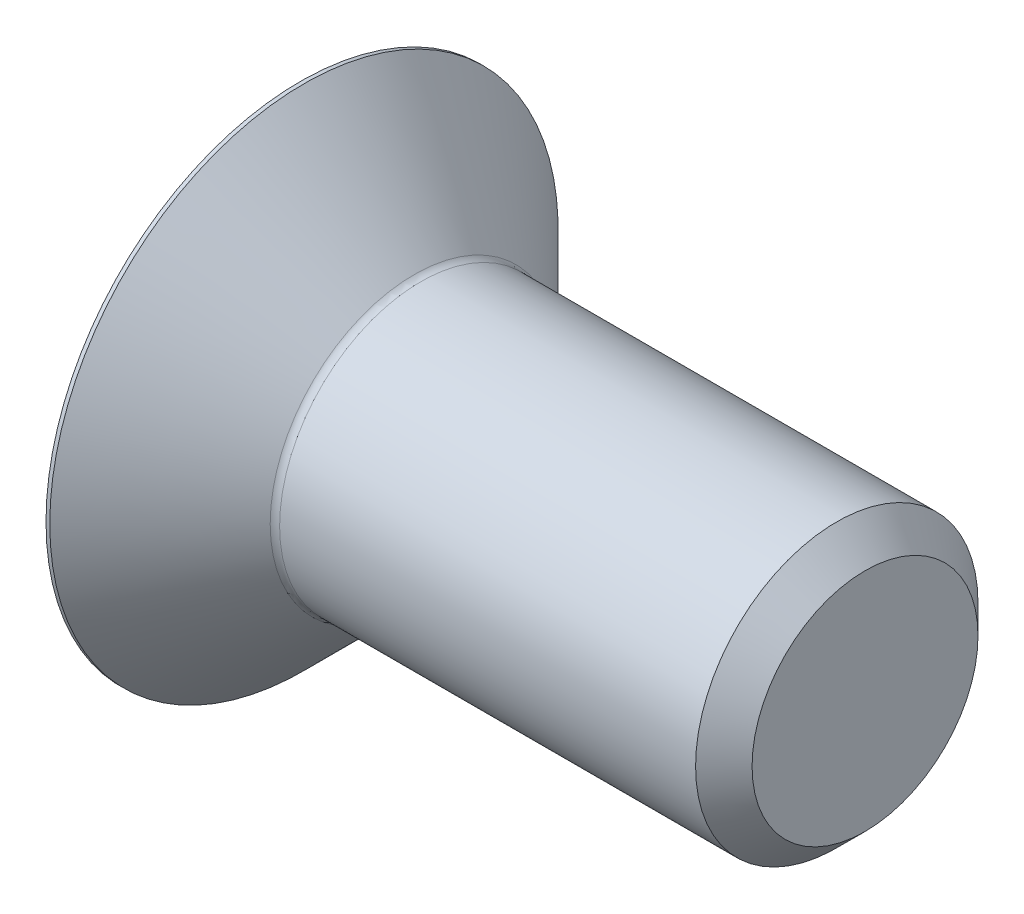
ISO-10303-21;
HEADER;
FILE_DESCRIPTION(('STEP AP214'),'2;1');
FILE_NAME('part.step','',(''),(''),'','','');
FILE_SCHEMA(('AUTOMOTIVE_DESIGN { 1 0 10303 214 1 1 1 1 }'));
ENDSEC;
DATA;
#1=APPLICATION_CONTEXT('core data for automotive mechanical design processes');
#2=APPLICATION_PROTOCOL_DEFINITION('international standard','automotive_design',2000,#1);
#3=PRODUCT_CONTEXT('',#1,'mechanical');
#4=PRODUCT('Part','Part','',(#3));
#5=PRODUCT_RELATED_PRODUCT_CATEGORY('part','',(#4));
#6=PRODUCT_DEFINITION_FORMATION('','',#4);
#7=PRODUCT_DEFINITION_CONTEXT('part definition',#1,'design');
#8=PRODUCT_DEFINITION('design','',#6,#7);
#9=PRODUCT_DEFINITION_SHAPE('','',#8);
#10=(LENGTH_UNIT() NAMED_UNIT(*) SI_UNIT(.MILLI.,.METRE.));
#11=(NAMED_UNIT(*) PLANE_ANGLE_UNIT() SI_UNIT($,.RADIAN.));
#12=(NAMED_UNIT(*) SI_UNIT($,.STERADIAN.) SOLID_ANGLE_UNIT());
#13=UNCERTAINTY_MEASURE_WITH_UNIT(LENGTH_MEASURE(1.E-05),#10,'distance_accuracy_value','');
#14=(GEOMETRIC_REPRESENTATION_CONTEXT(3) GLOBAL_UNCERTAINTY_ASSIGNED_CONTEXT((#13)) GLOBAL_UNIT_ASSIGNED_CONTEXT((#10,
#11,#12)) REPRESENTATION_CONTEXT('',''));
#15=CARTESIAN_POINT('',(0.,0.,0.));
#16=DIRECTION('',(0.,0.,1.));
#17=DIRECTION('',(1.,0.,0.));
#18=AXIS2_PLACEMENT_3D('',#15,#16,#17);
#19=CARTESIAN_POINT('',(0.,0.,0.));
#20=DIRECTION('',(-1.,0.,0.));
#21=DIRECTION('',(0.,0.,1.));
#22=AXIS2_PLACEMENT_3D('',#19,#20,#21);
#23=PLANE('',#22);
#24=CARTESIAN_POINT('',(0.,0.,0.));
#25=DIRECTION('',(-1.,0.,0.));
#26=DIRECTION('',(0.,0.,1.));
#27=AXIS2_PLACEMENT_3D('',#24,#25,#26);
#28=CIRCLE('',#27,5.4);
#29=CARTESIAN_POINT('',(0.,0.,5.4));
#30=VERTEX_POINT('',#29);
#31=EDGE_CURVE('E132',#30,#30,#28,.T.);
#32=ORIENTED_EDGE('',*,*,#31,.T.);
#33=EDGE_LOOP('',(#32));
#34=FACE_BOUND('',#33,.T.);
#35=DIRECTION('',(0.,-0.499999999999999,-0.866025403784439));
#36=VECTOR('',#35,1.);
#37=CARTESIAN_POINT('',(0.,-1.15470053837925,2.));
#38=LINE('',#37,#36);
#39=CARTESIAN_POINT('',(0.,-1.15470053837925,2.));
#40=VERTEX_POINT('',#39);
#41=CARTESIAN_POINT('',(0.,-2.3094010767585,0.));
#42=VERTEX_POINT('',#41);
#43=EDGE_CURVE('E109',#40,#42,#38,.T.);
#44=ORIENTED_EDGE('',*,*,#43,.T.);
#45=DIRECTION('',(0.,0.5,-0.866025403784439));
#46=VECTOR('',#45,1.);
#47=CARTESIAN_POINT('',(0.,-2.3094010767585,0.));
#48=LINE('',#47,#46);
#49=CARTESIAN_POINT('',(0.,-1.15470053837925,-2.));
#50=VERTEX_POINT('',#49);
#51=EDGE_CURVE('E54',#42,#50,#48,.T.);
#52=ORIENTED_EDGE('',*,*,#51,.T.);
#53=DIRECTION('',(0.,1.,0.));
#54=VECTOR('',#53,1.);
#55=CARTESIAN_POINT('',(0.,-1.15470053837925,-2.));
#56=LINE('',#55,#54);
#57=CARTESIAN_POINT('',(0.,1.15470053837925,-2.));
#58=VERTEX_POINT('',#57);
#59=EDGE_CURVE('E113',#50,#58,#56,.T.);
#60=ORIENTED_EDGE('',*,*,#59,.T.);
#61=DIRECTION('',(0.,0.5,0.866025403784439));
#62=VECTOR('',#61,1.);
#63=CARTESIAN_POINT('',(0.,1.15470053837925,-2.));
#64=LINE('',#63,#62);
#65=CARTESIAN_POINT('',(0.,2.3094010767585,0.));
#66=VERTEX_POINT('',#65);
#67=EDGE_CURVE('E209',#58,#66,#64,.T.);
#68=ORIENTED_EDGE('',*,*,#67,.T.);
#69=DIRECTION('',(0.,-0.5,0.866025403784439));
#70=VECTOR('',#69,1.);
#71=CARTESIAN_POINT('',(0.,2.3094010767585,0.));
#72=LINE('',#71,#70);
#73=CARTESIAN_POINT('',(0.,1.15470053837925,2.));
#74=VERTEX_POINT('',#73);
#75=EDGE_CURVE('E206',#66,#74,#72,.T.);
#76=ORIENTED_EDGE('',*,*,#75,.T.);
#77=DIRECTION('',(0.,-1.,0.));
#78=VECTOR('',#77,1.);
#79=CARTESIAN_POINT('',(0.,1.15470053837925,2.));
#80=LINE('',#79,#78);
#81=EDGE_CURVE('E200',#74,#40,#80,.T.);
#82=ORIENTED_EDGE('',*,*,#81,.T.);
#83=EDGE_LOOP('',(#44,#52,#60,#68,#76,#82));
#84=FACE_BOUND('',#83,.T.);
#85=ADVANCED_FACE('F39',(#34,#84),#23,.T.);
#86=CARTESIAN_POINT('',(0.,0.,0.));
#87=DIRECTION('',(-1.,0.,0.));
#88=DIRECTION('',(0.,0.,1.));
#89=AXIS2_PLACEMENT_3D('',#86,#87,#88);
#90=CYLINDRICAL_SURFACE('',#89,5.4);
#91=CARTESIAN_POINT('',(0.0800000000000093,0.,0.));
#92=DIRECTION('',(-1.,0.,0.));
#93=DIRECTION('',(0.,0.,1.));
#94=AXIS2_PLACEMENT_3D('',#91,#92,#93);
#95=CIRCLE('',#94,5.4);
#96=CARTESIAN_POINT('',(0.0800000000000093,0.,5.4));
#97=VERTEX_POINT('',#96);
#98=EDGE_CURVE('E129',#97,#97,#95,.T.);
#99=ORIENTED_EDGE('',*,*,#98,.T.);
#100=EDGE_LOOP('',(#99));
#101=FACE_BOUND('',#100,.T.);
#102=ORIENTED_EDGE('',*,*,#31,.F.);
#103=EDGE_LOOP('',(#102));
#104=FACE_BOUND('',#103,.T.);
#105=ADVANCED_FACE('F153',(#101,#104),#90,.T.);
#106=CARTESIAN_POINT('',(0.0800000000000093,0.,0.));
#107=DIRECTION('',(-1.,0.,0.));
#108=DIRECTION('',(0.,0.,1.));
#109=AXIS2_PLACEMENT_3D('',#106,#107,#108);
#110=CONICAL_SURFACE('',#109,5.4,0.78539816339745);
#111=CARTESIAN_POINT('',(2.42142135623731,0.,0.));
#112=DIRECTION('',(-1.,0.,0.));
#113=DIRECTION('',(0.,0.,1.));
#114=AXIS2_PLACEMENT_3D('',#111,#112,#113);
#115=CIRCLE('',#114,3.05857864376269);
#116=CARTESIAN_POINT('',(2.42142135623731,0.,3.05857864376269));
#117=VERTEX_POINT('',#116);
#118=EDGE_CURVE('E47',#117,#117,#115,.T.);
#119=ORIENTED_EDGE('',*,*,#118,.T.);
#120=EDGE_LOOP('',(#119));
#121=FACE_BOUND('',#120,.T.);
#122=ORIENTED_EDGE('',*,*,#98,.F.);
#123=EDGE_LOOP('',(#122));
#124=FACE_BOUND('',#123,.T.);
#125=ADVANCED_FACE('F137',(#121,#124),#110,.T.);
#126=CARTESIAN_POINT('',(0.,0.,0.));
#127=DIRECTION('',(-1.,0.,0.));
#128=DIRECTION('',(0.,0.,1.));
#129=AXIS2_PLACEMENT_3D('',#126,#127,#128);
#130=CYLINDRICAL_SURFACE('',#129,3.);
#131=CARTESIAN_POINT('',(2.56284271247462,0.,0.));
#132=DIRECTION('',(-1.,0.,0.));
#133=DIRECTION('',(0.,0.,1.));
#134=AXIS2_PLACEMENT_3D('',#131,#132,#133);
#135=CIRCLE('',#134,3.);
#136=CARTESIAN_POINT('',(2.56284271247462,0.,3.));
#137=VERTEX_POINT('',#136);
#138=EDGE_CURVE('E11',#137,#137,#135,.F.);
#139=ORIENTED_EDGE('',*,*,#138,.T.);
#140=EDGE_LOOP('',(#139));
#141=FACE_BOUND('',#140,.T.);
#142=CARTESIAN_POINT('',(11.4,0.,0.));
#143=DIRECTION('',(-1.,0.,0.));
#144=DIRECTION('',(0.,0.,1.));
#145=AXIS2_PLACEMENT_3D('',#142,#143,#144);
#146=CIRCLE('',#145,2.99999999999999);
#147=CARTESIAN_POINT('',(11.4,0.,2.99999999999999));
#148=VERTEX_POINT('',#147);
#149=EDGE_CURVE('E126',#148,#148,#146,.T.);
#150=ORIENTED_EDGE('',*,*,#149,.T.);
#151=EDGE_LOOP('',(#150));
#152=FACE_BOUND('',#151,.T.);
#153=ADVANCED_FACE('F164',(#141,#152),#130,.T.);
#154=CARTESIAN_POINT('',(12.,0.,0.));
#155=DIRECTION('',(-1.,0.,0.));
#156=DIRECTION('',(0.,0.,1.));
#157=AXIS2_PLACEMENT_3D('',#154,#155,#156);
#158=CONICAL_SURFACE('',#157,2.4,0.78539816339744);
#159=ORIENTED_EDGE('',*,*,#149,.F.);
#160=EDGE_LOOP('',(#159));
#161=FACE_BOUND('',#160,.T.);
#162=CARTESIAN_POINT('',(12.,0.,0.));
#163=DIRECTION('',(-1.,0.,0.));
#164=DIRECTION('',(0.,0.,1.));
#165=AXIS2_PLACEMENT_3D('',#162,#163,#164);
#166=CIRCLE('',#165,2.4);
#167=CARTESIAN_POINT('',(12.,0.,2.4));
#168=VERTEX_POINT('',#167);
#169=EDGE_CURVE('E118',#168,#168,#166,.T.);
#170=ORIENTED_EDGE('',*,*,#169,.T.);
#171=EDGE_LOOP('',(#170));
#172=FACE_BOUND('',#171,.T.);
#173=ADVANCED_FACE('F148',(#161,#172),#158,.T.);
#174=CARTESIAN_POINT('',(12.,2.4,0.));
#175=DIRECTION('',(1.,0.,0.));
#176=DIRECTION('',(0.,0.,-1.));
#177=AXIS2_PLACEMENT_3D('',#174,#175,#176);
#178=PLANE('',#177);
#179=ORIENTED_EDGE('',*,*,#169,.F.);
#180=EDGE_LOOP('',(#179));
#181=FACE_BOUND('',#180,.T.);
#182=ADVANCED_FACE('F141',(#181),#178,.T.);
#183=CARTESIAN_POINT('',(2.56284271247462,0.,0.));
#184=DIRECTION('',(-1.,0.,0.));
#185=DIRECTION('',(0.,0.,1.));
#186=AXIS2_PLACEMENT_3D('',#183,#184,#185);
#187=TOROIDAL_SURFACE('',#186,3.2,0.2);
#188=ORIENTED_EDGE('',*,*,#138,.F.);
#189=EDGE_LOOP('',(#188));
#190=FACE_BOUND('',#189,.T.);
#191=ORIENTED_EDGE('',*,*,#118,.F.);
#192=EDGE_LOOP('',(#191));
#193=FACE_BOUND('',#192,.T.);
#194=ADVANCED_FACE('F41',(#190,#193),#187,.F.);
#195=CARTESIAN_POINT('',(1.5,-1.15470053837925,-2.));
#196=DIRECTION('',(1.,0.,0.));
#197=DIRECTION('',(0.,0.,-1.));
#198=AXIS2_PLACEMENT_3D('',#195,#196,#197);
#199=PLANE('',#198);
#200=DIRECTION('',(0.,0.5,-0.866025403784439));
#201=VECTOR('',#200,1.);
#202=CARTESIAN_POINT('',(1.5,-2.3094010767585,0.));
#203=LINE('',#202,#201);
#204=CARTESIAN_POINT('',(1.5,-2.3094010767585,0.));
#205=VERTEX_POINT('',#204);
#206=CARTESIAN_POINT('',(1.5,-1.15470053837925,-2.));
#207=VERTEX_POINT('',#206);
#208=EDGE_CURVE('E99',#205,#207,#203,.T.);
#209=ORIENTED_EDGE('',*,*,#208,.F.);
#210=DIRECTION('',(0.,-0.499999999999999,-0.866025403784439));
#211=VECTOR('',#210,1.);
#212=CARTESIAN_POINT('',(1.5,-1.15470053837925,2.));
#213=LINE('',#212,#211);
#214=CARTESIAN_POINT('',(1.5,-1.15470053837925,2.));
#215=VERTEX_POINT('',#214);
#216=EDGE_CURVE('E214',#215,#205,#213,.T.);
#217=ORIENTED_EDGE('',*,*,#216,.F.);
#218=DIRECTION('',(0.,-1.,0.));
#219=VECTOR('',#218,1.);
#220=CARTESIAN_POINT('',(1.5,1.15470053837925,2.));
#221=LINE('',#220,#219);
#222=CARTESIAN_POINT('',(1.5,1.15470053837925,2.));
#223=VERTEX_POINT('',#222);
#224=EDGE_CURVE('E223',#223,#215,#221,.T.);
#225=ORIENTED_EDGE('',*,*,#224,.F.);
#226=DIRECTION('',(0.,-0.5,0.866025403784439));
#227=VECTOR('',#226,1.);
#228=CARTESIAN_POINT('',(1.5,2.3094010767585,0.));
#229=LINE('',#228,#227);
#230=CARTESIAN_POINT('',(1.5,2.3094010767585,0.));
#231=VERTEX_POINT('',#230);
#232=EDGE_CURVE('E225',#231,#223,#229,.T.);
#233=ORIENTED_EDGE('',*,*,#232,.F.);
#234=DIRECTION('',(0.,0.5,0.866025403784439));
#235=VECTOR('',#234,1.);
#236=CARTESIAN_POINT('',(1.5,1.15470053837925,-2.));
#237=LINE('',#236,#235);
#238=CARTESIAN_POINT('',(1.5,1.15470053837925,-2.));
#239=VERTEX_POINT('',#238);
#240=EDGE_CURVE('E101',#239,#231,#237,.T.);
#241=ORIENTED_EDGE('',*,*,#240,.F.);
#242=DIRECTION('',(0.,1.,0.));
#243=VECTOR('',#242,1.);
#244=CARTESIAN_POINT('',(1.5,-1.15470053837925,-2.));
#245=LINE('',#244,#243);
#246=EDGE_CURVE('E94',#207,#239,#245,.T.);
#247=ORIENTED_EDGE('',*,*,#246,.F.);
#248=EDGE_LOOP('',(#209,#217,#225,#233,#241,#247));
#249=FACE_BOUND('',#248,.T.);
#250=CARTESIAN_POINT('',(1.5,0.,0.));
#251=DIRECTION('',(1.,0.,0.));
#252=DIRECTION('',(0.,0.,-1.));
#253=AXIS2_PLACEMENT_3D('',#250,#251,#252);
#254=CIRCLE('',#253,1.25);
#255=CARTESIAN_POINT('',(1.5,0.,-1.25));
#256=VERTEX_POINT('',#255);
#257=EDGE_CURVE('E114',#256,#256,#254,.F.);
#258=ORIENTED_EDGE('',*,*,#257,.F.);
#259=EDGE_LOOP('',(#258));
#260=FACE_BOUND('',#259,.T.);
#261=ADVANCED_FACE('F96',(#249,#260),#199,.F.);
#262=CARTESIAN_POINT('',(1.5,-2.3094010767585,0.));
#263=DIRECTION('',(0.,0.866025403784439,0.5));
#264=DIRECTION('',(0.,-0.5,0.866025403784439));
#265=AXIS2_PLACEMENT_3D('',#262,#263,#264);
#266=PLANE('',#265);
#267=ORIENTED_EDGE('',*,*,#51,.F.);
#268=DIRECTION('',(-1.,0.,0.));
#269=VECTOR('',#268,1.);
#270=CARTESIAN_POINT('',(1.5,-2.3094010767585,0.));
#271=LINE('',#270,#269);
#272=EDGE_CURVE('E108',#205,#42,#271,.T.);
#273=ORIENTED_EDGE('',*,*,#272,.F.);
#274=ORIENTED_EDGE('',*,*,#208,.T.);
#275=DIRECTION('',(-1.,0.,0.));
#276=VECTOR('',#275,1.);
#277=CARTESIAN_POINT('',(1.5,-1.15470053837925,-2.));
#278=LINE('',#277,#276);
#279=EDGE_CURVE('E107',#207,#50,#278,.T.);
#280=ORIENTED_EDGE('',*,*,#279,.T.);
#281=EDGE_LOOP('',(#267,#273,#274,#280));
#282=FACE_BOUND('',#281,.T.);
#283=ADVANCED_FACE('F106',(#282),#266,.T.);
#284=CARTESIAN_POINT('',(1.5,-1.15470053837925,-2.));
#285=DIRECTION('',(0.,0.,1.));
#286=DIRECTION('',(1.,0.,0.));
#287=AXIS2_PLACEMENT_3D('',#284,#285,#286);
#288=PLANE('',#287);
#289=ORIENTED_EDGE('',*,*,#59,.F.);
#290=ORIENTED_EDGE('',*,*,#279,.F.);
#291=ORIENTED_EDGE('',*,*,#246,.T.);
#292=DIRECTION('',(-1.,0.,0.));
#293=VECTOR('',#292,1.);
#294=CARTESIAN_POINT('',(1.5,1.15470053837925,-2.));
#295=LINE('',#294,#293);
#296=EDGE_CURVE('E115',#239,#58,#295,.T.);
#297=ORIENTED_EDGE('',*,*,#296,.T.);
#298=EDGE_LOOP('',(#289,#290,#291,#297));
#299=FACE_BOUND('',#298,.T.);
#300=ADVANCED_FACE('F111',(#299),#288,.T.);
#301=CARTESIAN_POINT('',(1.5,1.15470053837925,-2.));
#302=DIRECTION('',(0.,-0.866025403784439,0.5));
#303=DIRECTION('',(0.,-0.5,-0.866025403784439));
#304=AXIS2_PLACEMENT_3D('',#301,#302,#303);
#305=PLANE('',#304);
#306=ORIENTED_EDGE('',*,*,#67,.F.);
#307=ORIENTED_EDGE('',*,*,#296,.F.);
#308=ORIENTED_EDGE('',*,*,#240,.T.);
#309=DIRECTION('',(-1.,0.,0.));
#310=VECTOR('',#309,1.);
#311=CARTESIAN_POINT('',(1.5,2.3094010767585,0.));
#312=LINE('',#311,#310);
#313=EDGE_CURVE('E120',#231,#66,#312,.T.);
#314=ORIENTED_EDGE('',*,*,#313,.T.);
#315=EDGE_LOOP('',(#306,#307,#308,#314));
#316=FACE_BOUND('',#315,.T.);
#317=ADVANCED_FACE('F179',(#316),#305,.T.);
#318=CARTESIAN_POINT('',(1.5,2.3094010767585,0.));
#319=DIRECTION('',(0.,-0.866025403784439,-0.5));
#320=DIRECTION('',(0.,0.5,-0.866025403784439));
#321=AXIS2_PLACEMENT_3D('',#318,#319,#320);
#322=PLANE('',#321);
#323=ORIENTED_EDGE('',*,*,#75,.F.);
#324=ORIENTED_EDGE('',*,*,#313,.F.);
#325=ORIENTED_EDGE('',*,*,#232,.T.);
#326=DIRECTION('',(-1.,0.,0.));
#327=VECTOR('',#326,1.);
#328=CARTESIAN_POINT('',(1.5,1.15470053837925,2.));
#329=LINE('',#328,#327);
#330=EDGE_CURVE('E216',#223,#74,#329,.T.);
#331=ORIENTED_EDGE('',*,*,#330,.T.);
#332=EDGE_LOOP('',(#323,#324,#325,#331));
#333=FACE_BOUND('',#332,.T.);
#334=ADVANCED_FACE('F182',(#333),#322,.T.);
#335=CARTESIAN_POINT('',(1.5,1.15470053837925,2.));
#336=DIRECTION('',(0.,0.,-1.));
#337=DIRECTION('',(-1.,0.,0.));
#338=AXIS2_PLACEMENT_3D('',#335,#336,#337);
#339=PLANE('',#338);
#340=ORIENTED_EDGE('',*,*,#81,.F.);
#341=ORIENTED_EDGE('',*,*,#330,.F.);
#342=ORIENTED_EDGE('',*,*,#224,.T.);
#343=DIRECTION('',(-1.,0.,0.));
#344=VECTOR('',#343,1.);
#345=CARTESIAN_POINT('',(1.5,-1.15470053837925,2.));
#346=LINE('',#345,#344);
#347=EDGE_CURVE('E199',#215,#40,#346,.T.);
#348=ORIENTED_EDGE('',*,*,#347,.T.);
#349=EDGE_LOOP('',(#340,#341,#342,#348));
#350=FACE_BOUND('',#349,.T.);
#351=ADVANCED_FACE('F186',(#350),#339,.T.);
#352=CARTESIAN_POINT('',(1.5,-1.15470053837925,2.));
#353=DIRECTION('',(0.,0.866025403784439,-0.5));
#354=DIRECTION('',(0.,0.5,0.866025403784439));
#355=AXIS2_PLACEMENT_3D('',#352,#353,#354);
#356=PLANE('',#355);
#357=ORIENTED_EDGE('',*,*,#43,.F.);
#358=ORIENTED_EDGE('',*,*,#347,.F.);
#359=ORIENTED_EDGE('',*,*,#216,.T.);
#360=ORIENTED_EDGE('',*,*,#272,.T.);
#361=EDGE_LOOP('',(#357,#358,#359,#360));
#362=FACE_BOUND('',#361,.T.);
#363=ADVANCED_FACE('F174',(#362),#356,.T.);
#364=CARTESIAN_POINT('',(1.5,0.,0.));
#365=DIRECTION('',(-1.,0.,0.));
#366=DIRECTION('',(0.,0.,1.));
#367=AXIS2_PLACEMENT_3D('',#364,#365,#366);
#368=CONICAL_SURFACE('',#367,1.25,1.04719755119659);
#369=CARTESIAN_POINT('',(2.22168783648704,0.,0.));
#370=VERTEX_POINT('',#369);
#371=VERTEX_LOOP('',#370);
#372=FACE_BOUND('',#371,.T.);
#373=ORIENTED_EDGE('',*,*,#257,.T.);
#374=EDGE_LOOP('',(#373));
#375=FACE_BOUND('',#374,.T.);
#376=ADVANCED_FACE('F171',(#372,#375),#368,.F.);
#377=CLOSED_SHELL('',(#85,#105,#125,#153,#173,#182,#194,#261,#283,#300,#317,#334,#351,#363,#376));
#378=MANIFOLD_SOLID_BREP('B2',#377);
#379=ADVANCED_BREP_SHAPE_REPRESENTATION('',(#18,#378),#14);
#380=SHAPE_DEFINITION_REPRESENTATION(#9,#379);
ENDSEC;
END-ISO-10303-21;
